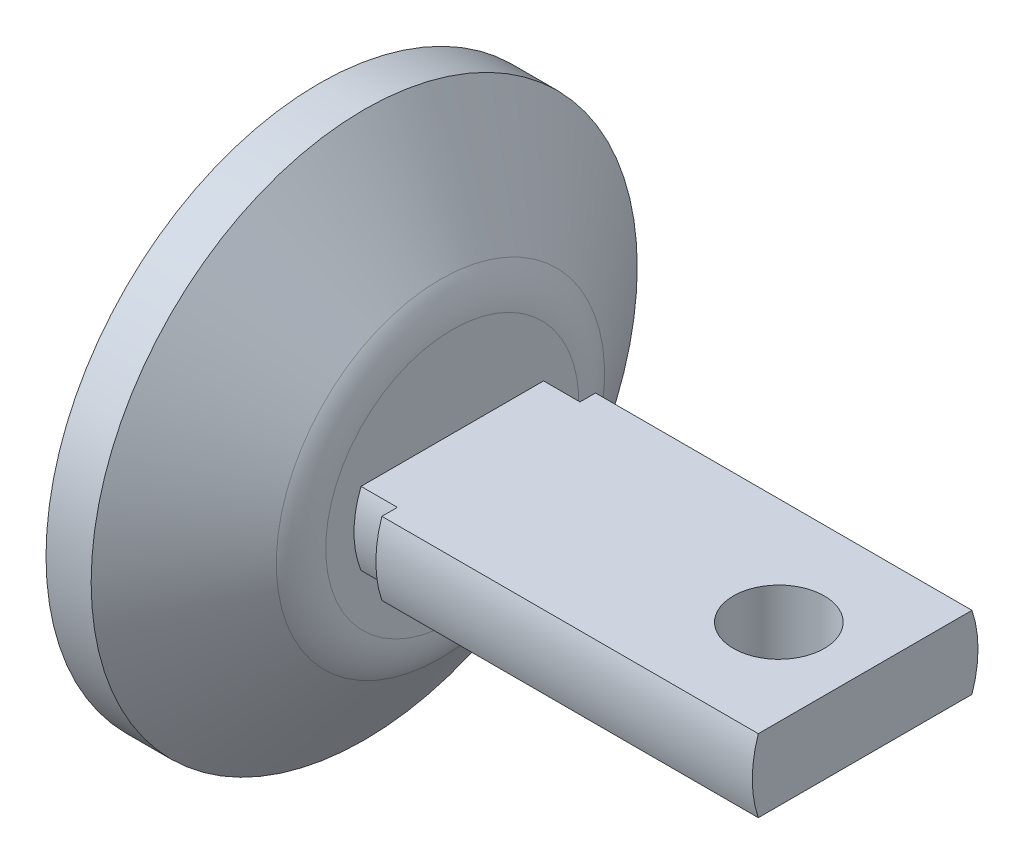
from build123d import *

# Parameters (mm, degrees)
CUT_EXTRUDE2_REACH  = 25.331
SKETCH2_R           = 5.08
CUT_EXTRUDE3_REACH  = 31.639
SKETCH4_R           = 1.5875
BOSS_EXTRUDE2_DEPTH = 6.858
SKETCH7_R           = 2.434091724
SKETCH7_R_2         = 2.0193
CUT_EXTRUDE5_DEPTH  = 3.5052


with BuildPart() as part:
    # Sketch1 → Revolve1 (revolve)
    with BuildSketch(Plane.XY, mode=Mode.PRIVATE) as revolve1_sk:
        with BuildLine():
            Line((6.858, 0), (6.858, 9.525))
            Line((6.858, 9.525), (8.4328, 9.525))
            Line((8.4328, 9.525), (11.092781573, 5.726152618))
            ThreePointArc((11.092781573, 5.726152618), (11.400396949, 5.102370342), (11.5062, 4.414956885))
            Line((11.5062, 4.414956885), (11.5062, 3.429))
            Line((11.5062, 3.429), (12.7762, 3.429))
            Line((12.7762, 3.429), (12.7762, 3.937))
            Line((12.7762, 3.937), (25.908, 3.937))
            Line((25.908, 3.937), (25.908, 0))
            Line((25.908, 0), (6.858, 0))
        make_face()
    revolve(revolve1_sk.sketch.rotate(Axis((6.858, 0, 0), (1, 0, 0)), 180), axis=Axis((6.858, 0, 0), (1, 0, 0)))

    # Cut-Extrude2: up to this face of the body (flat: up to its plane)
    cut_extrude2_end = Plane(part.part.faces().sort_by_distance((11.5062, 4.290083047, 0))[0])
    # Sketch2 → Cut-Extrude2 (cut, up to the picked face)
    with BuildSketch(Plane(origin=(25.908, 0, 0), x_dir=(0, 0, -1), z_dir=(1, 0, 0)), mode=Mode.PRIVATE) as cut_extrude2_sk1:
        Circle(SKETCH2_R)
        with BuildLine():
            Line((3.860465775, 1.27), (-3.860465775, 1.27))
            ThreePointArc((-3.860465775, 1.27), (-4.064, 0), (-3.860465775, -1.27))
            Line((-3.860465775, -1.27), (3.860465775, -1.27))
            ThreePointArc((3.860465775, -1.27), (4.064, 0), (3.860465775, 1.27))
        make_face(mode=Mode.SUBTRACT)
    cut_extrude2_tool1 = split(extrude(cut_extrude2_sk1.sketch, amount=-CUT_EXTRUDE2_REACH, mode=Mode.PRIVATE), bisect_by=cut_extrude2_end, keep=Keep.BOTH, mode=Mode.PRIVATE)
    add(cut_extrude2_tool1.solids().sort_by(Axis((25.908, 0, 4.936316), (-1, 0, 0)))[0], mode=Mode.SUBTRACT)

    # Sketch4 → Cut-Extrude3 (cut, up to next)
    with BuildSketch(Plane(origin=(0, 1.27, 0), x_dir=(1, 0, 0), z_dir=(0, 1, 0)), mode=Mode.PRIVATE) as cut_extrude3_sk1:
        with Locations(Location((22.8981, 0, 0), (0, 0, 270))):
            Circle(SKETCH4_R)
    cut_extrude3_tool1 = extrude(cut_extrude3_sk1.sketch, amount=-CUT_EXTRUDE3_REACH, mode=Mode.PRIVATE) & part.part
    add(cut_extrude3_tool1.solids().sort_by_distance((22.8981, 1.27, 0))[0], mode=Mode.SUBTRACT)

    # Sketch5 → Boss-Extrude2 (add)
    with BuildSketch(Plane.ZY.offset(-6.858)):
        with BuildLine():
            Line((-4.314220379, -0.377445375), (-4.29208282, -0.630478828))
            ThreePointArc((-4.29208282, -0.630478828), (-6.127705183, -2.818088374), (-8.315314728, -0.982466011))
            Line((-8.315314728, -0.982466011), (-8.337452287, -0.729432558))
            ThreePointArc((-8.337452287, -0.729432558), (-6.501829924, 1.458176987), (-4.314220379, -0.377445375))
        make_face()
    extrude(amount=BOSS_EXTRUDE2_DEPTH)

    # Sketch7 → Cut-Extrude5 (cut)
    with BuildSketch(Plane.ZY.offset(-6.858)):
        with Locations((-6.325836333, -0.553438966)):
            Circle(SKETCH7_R)
        with Locations(Location((-6.325836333, -0.553438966, 0), (0, 0, 5))):
            Circle(SKETCH7_R_2, mode=Mode.SUBTRACT)
    extrude(amount=CUT_EXTRUDE5_DEPTH, mode=Mode.SUBTRACT)


solid = part.part
